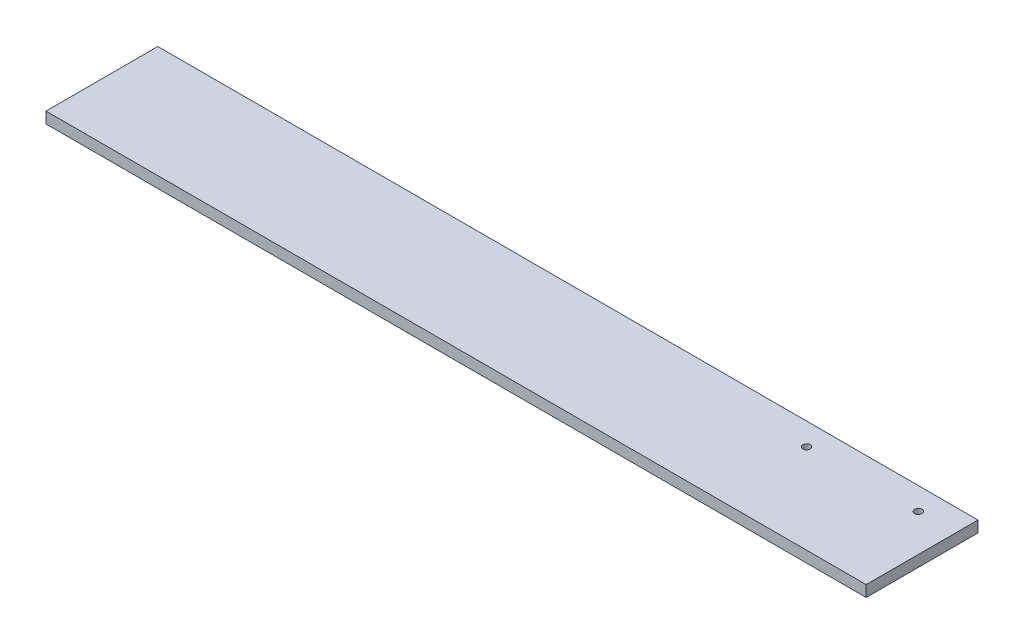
ISO-10303-21;
HEADER;
FILE_DESCRIPTION(('STEP AP214'),'2;1');
FILE_NAME('part.step','',(''),(''),'','','');
FILE_SCHEMA(('AUTOMOTIVE_DESIGN { 1 0 10303 214 1 1 1 1 }'));
ENDSEC;
DATA;
#1=APPLICATION_CONTEXT('core data for automotive mechanical design processes');
#2=APPLICATION_PROTOCOL_DEFINITION('international standard','automotive_design',2000,#1);
#3=PRODUCT_CONTEXT('',#1,'mechanical');
#4=PRODUCT('Part','Part','',(#3));
#5=PRODUCT_RELATED_PRODUCT_CATEGORY('part','',(#4));
#6=PRODUCT_DEFINITION_FORMATION('','',#4);
#7=PRODUCT_DEFINITION_CONTEXT('part definition',#1,'design');
#8=PRODUCT_DEFINITION('design','',#6,#7);
#9=PRODUCT_DEFINITION_SHAPE('','',#8);
#10=(LENGTH_UNIT() NAMED_UNIT(*) SI_UNIT(.MILLI.,.METRE.));
#11=(NAMED_UNIT(*) PLANE_ANGLE_UNIT() SI_UNIT($,.RADIAN.));
#12=(NAMED_UNIT(*) SI_UNIT($,.STERADIAN.) SOLID_ANGLE_UNIT());
#13=UNCERTAINTY_MEASURE_WITH_UNIT(LENGTH_MEASURE(1.E-05),#10,'distance_accuracy_value','');
#14=(GEOMETRIC_REPRESENTATION_CONTEXT(3) GLOBAL_UNCERTAINTY_ASSIGNED_CONTEXT((#13)) GLOBAL_UNIT_ASSIGNED_CONTEXT((#10,
#11,#12)) REPRESENTATION_CONTEXT('',''));
#15=CARTESIAN_POINT('',(0.,0.,0.));
#16=DIRECTION('',(0.,0.,1.));
#17=DIRECTION('',(1.,0.,0.));
#18=AXIS2_PLACEMENT_3D('',#15,#16,#17);
#19=CARTESIAN_POINT('',(110.,3.,-15.));
#20=DIRECTION('',(-1.,0.,0.));
#21=DIRECTION('',(0.,0.,1.));
#22=AXIS2_PLACEMENT_3D('',#19,#20,#21);
#23=PLANE('',#22);
#24=DIRECTION('',(0.,0.,-1.));
#25=VECTOR('',#24,1.);
#26=CARTESIAN_POINT('',(110.,0.,-15.));
#27=LINE('',#26,#25);
#28=CARTESIAN_POINT('',(110.,0.,15.));
#29=VERTEX_POINT('',#28);
#30=CARTESIAN_POINT('',(110.,0.,-15.));
#31=VERTEX_POINT('',#30);
#32=EDGE_CURVE('E95',#29,#31,#27,.T.);
#33=ORIENTED_EDGE('',*,*,#32,.T.);
#34=DIRECTION('',(0.,-1.,0.));
#35=VECTOR('',#34,1.);
#36=CARTESIAN_POINT('',(110.,3.,-15.));
#37=LINE('',#36,#35);
#38=CARTESIAN_POINT('',(110.,3.,-15.));
#39=VERTEX_POINT('',#38);
#40=EDGE_CURVE('E11',#39,#31,#37,.T.);
#41=ORIENTED_EDGE('',*,*,#40,.F.);
#42=DIRECTION('',(0.,0.,-1.));
#43=VECTOR('',#42,1.);
#44=CARTESIAN_POINT('',(110.,3.,-15.));
#45=LINE('',#44,#43);
#46=CARTESIAN_POINT('',(110.,3.,15.));
#47=VERTEX_POINT('',#46);
#48=EDGE_CURVE('E83',#47,#39,#45,.T.);
#49=ORIENTED_EDGE('',*,*,#48,.F.);
#50=DIRECTION('',(0.,-1.,0.));
#51=VECTOR('',#50,1.);
#52=CARTESIAN_POINT('',(110.,3.,15.));
#53=LINE('',#52,#51);
#54=EDGE_CURVE('E91',#47,#29,#53,.T.);
#55=ORIENTED_EDGE('',*,*,#54,.T.);
#56=EDGE_LOOP('',(#33,#41,#49,#55));
#57=FACE_BOUND('',#56,.T.);
#58=ADVANCED_FACE('F32',(#57),#23,.F.);
#59=CARTESIAN_POINT('',(-110.,3.,-15.));
#60=DIRECTION('',(0.,0.,1.));
#61=DIRECTION('',(1.,0.,0.));
#62=AXIS2_PLACEMENT_3D('',#59,#60,#61);
#63=PLANE('',#62);
#64=DIRECTION('',(-1.,0.,0.));
#65=VECTOR('',#64,1.);
#66=CARTESIAN_POINT('',(-110.,0.,-15.));
#67=LINE('',#66,#65);
#68=CARTESIAN_POINT('',(-110.,0.,-15.));
#69=VERTEX_POINT('',#68);
#70=EDGE_CURVE('E87',#31,#69,#67,.T.);
#71=ORIENTED_EDGE('',*,*,#70,.T.);
#72=DIRECTION('',(0.,-1.,0.));
#73=VECTOR('',#72,1.);
#74=CARTESIAN_POINT('',(-110.,3.,-15.));
#75=LINE('',#74,#73);
#76=CARTESIAN_POINT('',(-110.,3.,-15.));
#77=VERTEX_POINT('',#76);
#78=EDGE_CURVE('E40',#77,#69,#75,.T.);
#79=ORIENTED_EDGE('',*,*,#78,.F.);
#80=DIRECTION('',(-1.,0.,0.));
#81=VECTOR('',#80,1.);
#82=CARTESIAN_POINT('',(-110.,3.,-15.));
#83=LINE('',#82,#81);
#84=EDGE_CURVE('E78',#39,#77,#83,.T.);
#85=ORIENTED_EDGE('',*,*,#84,.F.);
#86=ORIENTED_EDGE('',*,*,#40,.T.);
#87=EDGE_LOOP('',(#71,#79,#85,#86));
#88=FACE_BOUND('',#87,.T.);
#89=ADVANCED_FACE('F86',(#88),#63,.F.);
#90=CARTESIAN_POINT('',(-110.,3.,-15.));
#91=DIRECTION('',(1.,0.,0.));
#92=DIRECTION('',(0.,0.,-1.));
#93=AXIS2_PLACEMENT_3D('',#90,#91,#92);
#94=PLANE('',#93);
#95=DIRECTION('',(0.,0.,1.));
#96=VECTOR('',#95,1.);
#97=CARTESIAN_POINT('',(-110.,0.,-15.));
#98=LINE('',#97,#96);
#99=CARTESIAN_POINT('',(-110.,0.,15.));
#100=VERTEX_POINT('',#99);
#101=EDGE_CURVE('E65',#69,#100,#98,.T.);
#102=ORIENTED_EDGE('',*,*,#101,.T.);
#103=DIRECTION('',(0.,-1.,0.));
#104=VECTOR('',#103,1.);
#105=CARTESIAN_POINT('',(-110.,3.,15.));
#106=LINE('',#105,#104);
#107=CARTESIAN_POINT('',(-110.,3.,15.));
#108=VERTEX_POINT('',#107);
#109=EDGE_CURVE('E88',#108,#100,#106,.T.);
#110=ORIENTED_EDGE('',*,*,#109,.F.);
#111=DIRECTION('',(0.,0.,1.));
#112=VECTOR('',#111,1.);
#113=CARTESIAN_POINT('',(-110.,3.,-15.));
#114=LINE('',#113,#112);
#115=EDGE_CURVE('E81',#77,#108,#114,.T.);
#116=ORIENTED_EDGE('',*,*,#115,.F.);
#117=ORIENTED_EDGE('',*,*,#78,.T.);
#118=EDGE_LOOP('',(#102,#110,#116,#117));
#119=FACE_BOUND('',#118,.T.);
#120=ADVANCED_FACE('F89',(#119),#94,.F.);
#121=CARTESIAN_POINT('',(-110.,3.,15.));
#122=DIRECTION('',(0.,0.,-1.));
#123=DIRECTION('',(-1.,0.,0.));
#124=AXIS2_PLACEMENT_3D('',#121,#122,#123);
#125=PLANE('',#124);
#126=DIRECTION('',(1.,0.,0.));
#127=VECTOR('',#126,1.);
#128=CARTESIAN_POINT('',(-110.,0.,15.));
#129=LINE('',#128,#127);
#130=EDGE_CURVE('E71',#100,#29,#129,.T.);
#131=ORIENTED_EDGE('',*,*,#130,.T.);
#132=ORIENTED_EDGE('',*,*,#54,.F.);
#133=DIRECTION('',(1.,0.,0.));
#134=VECTOR('',#133,1.);
#135=CARTESIAN_POINT('',(-110.,3.,15.));
#136=LINE('',#135,#134);
#137=EDGE_CURVE('E48',#108,#47,#136,.T.);
#138=ORIENTED_EDGE('',*,*,#137,.F.);
#139=ORIENTED_EDGE('',*,*,#109,.T.);
#140=EDGE_LOOP('',(#131,#132,#138,#139));
#141=FACE_BOUND('',#140,.T.);
#142=ADVANCED_FACE('F103',(#141),#125,.F.);
#143=CARTESIAN_POINT('',(0.,3.,0.));
#144=DIRECTION('',(0.,1.,0.));
#145=DIRECTION('',(0.,0.,1.));
#146=AXIS2_PLACEMENT_3D('',#143,#144,#145);
#147=PLANE('',#146);
#148=CARTESIAN_POINT('',(99.9999999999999,3.,-9.00000000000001));
#149=DIRECTION('',(0.,1.,0.));
#150=DIRECTION('',(0.,0.,1.));
#151=AXIS2_PLACEMENT_3D('',#148,#149,#150);
#152=CIRCLE('',#151,0.999999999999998);
#153=CARTESIAN_POINT('',(99.9999999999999,3.,-8.00000000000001));
#154=VERTEX_POINT('',#153);
#155=EDGE_CURVE('E115',#154,#154,#152,.T.);
#156=ORIENTED_EDGE('',*,*,#155,.F.);
#157=EDGE_LOOP('',(#156));
#158=FACE_BOUND('',#157,.T.);
#159=CARTESIAN_POINT('',(70.,3.,-9.));
#160=DIRECTION('',(0.,1.,0.));
#161=DIRECTION('',(0.,0.,1.));
#162=AXIS2_PLACEMENT_3D('',#159,#160,#161);
#163=CIRCLE('',#162,0.999999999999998);
#164=CARTESIAN_POINT('',(70.,3.,-8.));
#165=VERTEX_POINT('',#164);
#166=EDGE_CURVE('E109',#165,#165,#163,.T.);
#167=ORIENTED_EDGE('',*,*,#166,.F.);
#168=EDGE_LOOP('',(#167));
#169=FACE_BOUND('',#168,.T.);
#170=ORIENTED_EDGE('',*,*,#48,.T.);
#171=ORIENTED_EDGE('',*,*,#84,.T.);
#172=ORIENTED_EDGE('',*,*,#115,.T.);
#173=ORIENTED_EDGE('',*,*,#137,.T.);
#174=EDGE_LOOP('',(#170,#171,#172,#173));
#175=FACE_BOUND('',#174,.T.);
#176=ADVANCED_FACE('F79',(#158,#169,#175),#147,.T.);
#177=CARTESIAN_POINT('',(0.,0.,0.));
#178=DIRECTION('',(0.,1.,0.));
#179=DIRECTION('',(0.,0.,1.));
#180=AXIS2_PLACEMENT_3D('',#177,#178,#179);
#181=PLANE('',#180);
#182=CARTESIAN_POINT('',(99.9999999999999,0.,-9.00000000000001));
#183=DIRECTION('',(0.,1.,0.));
#184=DIRECTION('',(0.,0.,1.));
#185=AXIS2_PLACEMENT_3D('',#182,#183,#184);
#186=CIRCLE('',#185,0.999999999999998);
#187=CARTESIAN_POINT('',(99.9999999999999,0.,-8.00000000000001));
#188=VERTEX_POINT('',#187);
#189=EDGE_CURVE('E98',#188,#188,#186,.T.);
#190=ORIENTED_EDGE('',*,*,#189,.T.);
#191=EDGE_LOOP('',(#190));
#192=FACE_BOUND('',#191,.T.);
#193=CARTESIAN_POINT('',(70.,0.,-9.));
#194=DIRECTION('',(0.,1.,0.));
#195=DIRECTION('',(0.,0.,1.));
#196=AXIS2_PLACEMENT_3D('',#193,#194,#195);
#197=CIRCLE('',#196,0.999999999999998);
#198=CARTESIAN_POINT('',(70.,0.,-8.));
#199=VERTEX_POINT('',#198);
#200=EDGE_CURVE('E112',#199,#199,#197,.T.);
#201=ORIENTED_EDGE('',*,*,#200,.T.);
#202=EDGE_LOOP('',(#201));
#203=FACE_BOUND('',#202,.T.);
#204=ORIENTED_EDGE('',*,*,#32,.F.);
#205=ORIENTED_EDGE('',*,*,#130,.F.);
#206=ORIENTED_EDGE('',*,*,#101,.F.);
#207=ORIENTED_EDGE('',*,*,#70,.F.);
#208=EDGE_LOOP('',(#204,#205,#206,#207));
#209=FACE_BOUND('',#208,.T.);
#210=ADVANCED_FACE('F106',(#192,#203,#209),#181,.F.);
#211=CARTESIAN_POINT('',(70.,0.,-9.));
#212=DIRECTION('',(0.,1.,0.));
#213=DIRECTION('',(0.,0.,1.));
#214=AXIS2_PLACEMENT_3D('',#211,#212,#213);
#215=CYLINDRICAL_SURFACE('',#214,0.999999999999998);
#216=ORIENTED_EDGE('',*,*,#200,.F.);
#217=EDGE_LOOP('',(#216));
#218=FACE_BOUND('',#217,.T.);
#219=ORIENTED_EDGE('',*,*,#166,.T.);
#220=EDGE_LOOP('',(#219));
#221=FACE_BOUND('',#220,.T.);
#222=ADVANCED_FACE('F126',(#218,#221),#215,.F.);
#223=CARTESIAN_POINT('',(99.9999999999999,0.,-9.00000000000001));
#224=DIRECTION('',(0.,1.,0.));
#225=DIRECTION('',(0.,0.,1.));
#226=AXIS2_PLACEMENT_3D('',#223,#224,#225);
#227=CYLINDRICAL_SURFACE('',#226,0.999999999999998);
#228=ORIENTED_EDGE('',*,*,#189,.F.);
#229=EDGE_LOOP('',(#228));
#230=FACE_BOUND('',#229,.T.);
#231=ORIENTED_EDGE('',*,*,#155,.T.);
#232=EDGE_LOOP('',(#231));
#233=FACE_BOUND('',#232,.T.);
#234=ADVANCED_FACE('F123',(#230,#233),#227,.F.);
#235=CLOSED_SHELL('',(#58,#89,#120,#142,#176,#210,#222,#234));
#236=MANIFOLD_SOLID_BREP('B2',#235);
#237=ADVANCED_BREP_SHAPE_REPRESENTATION('',(#18,#236),#14);
#238=SHAPE_DEFINITION_REPRESENTATION(#9,#237);
ENDSEC;
END-ISO-10303-21;
